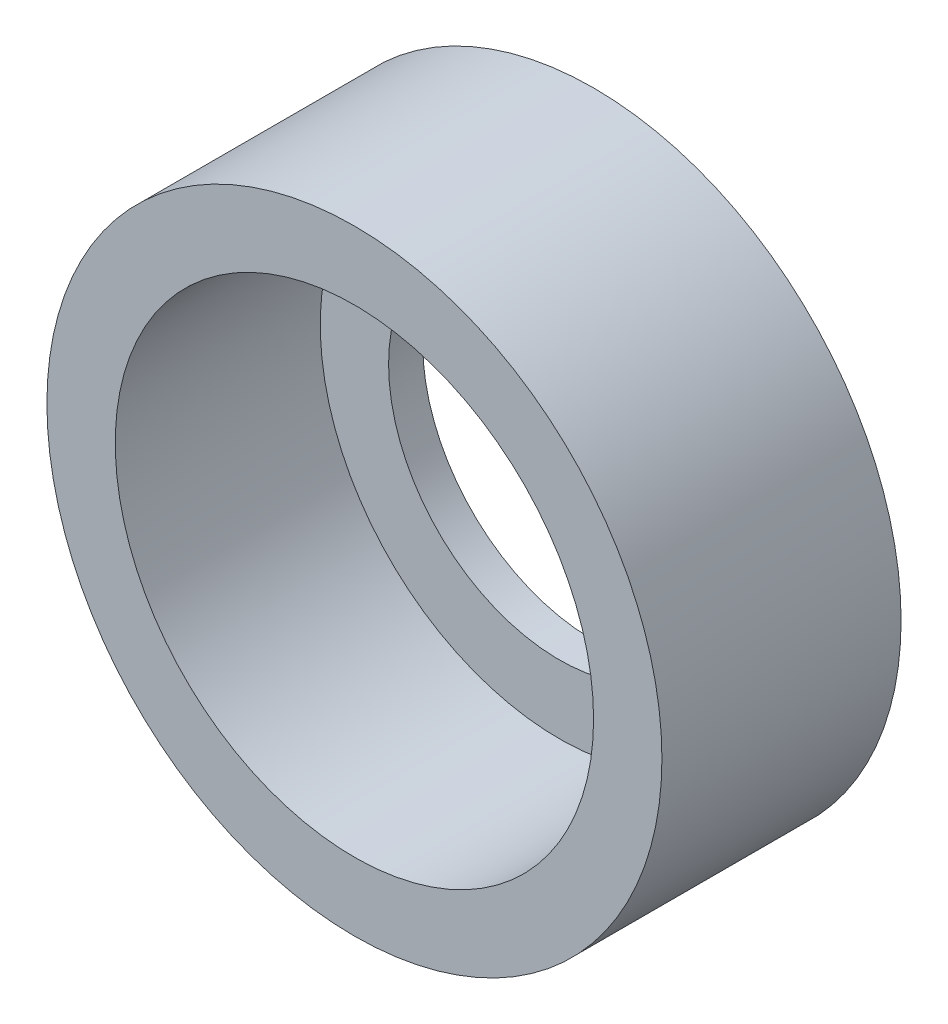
ISO-10303-21;
HEADER;
FILE_DESCRIPTION(('STEP AP214'),'2;1');
FILE_NAME('part.step','',(''),(''),'','','');
FILE_SCHEMA(('AUTOMOTIVE_DESIGN { 1 0 10303 214 1 1 1 1 }'));
ENDSEC;
DATA;
#1=APPLICATION_CONTEXT('core data for automotive mechanical design processes');
#2=APPLICATION_PROTOCOL_DEFINITION('international standard','automotive_design',2000,#1);
#3=PRODUCT_CONTEXT('',#1,'mechanical');
#4=PRODUCT('Part','Part','',(#3));
#5=PRODUCT_RELATED_PRODUCT_CATEGORY('part','',(#4));
#6=PRODUCT_DEFINITION_FORMATION('','',#4);
#7=PRODUCT_DEFINITION_CONTEXT('part definition',#1,'design');
#8=PRODUCT_DEFINITION('design','',#6,#7);
#9=PRODUCT_DEFINITION_SHAPE('','',#8);
#10=(LENGTH_UNIT() NAMED_UNIT(*) SI_UNIT(.MILLI.,.METRE.));
#11=(NAMED_UNIT(*) PLANE_ANGLE_UNIT() SI_UNIT($,.RADIAN.));
#12=(NAMED_UNIT(*) SI_UNIT($,.STERADIAN.) SOLID_ANGLE_UNIT());
#13=UNCERTAINTY_MEASURE_WITH_UNIT(LENGTH_MEASURE(1.E-05),#10,'distance_accuracy_value','');
#14=(GEOMETRIC_REPRESENTATION_CONTEXT(3) GLOBAL_UNCERTAINTY_ASSIGNED_CONTEXT((#13)) GLOBAL_UNIT_ASSIGNED_CONTEXT((#10,
#11,#12)) REPRESENTATION_CONTEXT('',''));
#15=CARTESIAN_POINT('',(0.,0.,0.));
#16=DIRECTION('',(0.,0.,1.));
#17=DIRECTION('',(1.,0.,0.));
#18=AXIS2_PLACEMENT_3D('',#15,#16,#17);
#19=CARTESIAN_POINT('',(0.,0.,3.5));
#20=DIRECTION('',(0.,0.,-1.));
#21=DIRECTION('',(-1.,0.,0.));
#22=AXIS2_PLACEMENT_3D('',#19,#20,#21);
#23=CYLINDRICAL_SURFACE('',#22,4.5);
#24=CARTESIAN_POINT('',(0.,0.,3.5));
#25=DIRECTION('',(0.,0.,1.));
#26=DIRECTION('',(1.,0.,0.));
#27=AXIS2_PLACEMENT_3D('',#24,#25,#26);
#28=CIRCLE('',#27,4.5);
#29=CARTESIAN_POINT('',(4.5,0.,3.5));
#30=VERTEX_POINT('',#29);
#31=EDGE_CURVE('E10',#30,#30,#28,.T.);
#32=ORIENTED_EDGE('',*,*,#31,.F.);
#33=EDGE_LOOP('',(#32));
#34=FACE_BOUND('',#33,.T.);
#35=CARTESIAN_POINT('',(0.,0.,0.));
#36=DIRECTION('',(0.,0.,1.));
#37=DIRECTION('',(1.,0.,0.));
#38=AXIS2_PLACEMENT_3D('',#35,#36,#37);
#39=CIRCLE('',#38,4.5);
#40=CARTESIAN_POINT('',(4.5,0.,0.));
#41=VERTEX_POINT('',#40);
#42=EDGE_CURVE('E34',#41,#41,#39,.T.);
#43=ORIENTED_EDGE('',*,*,#42,.T.);
#44=EDGE_LOOP('',(#43));
#45=FACE_BOUND('',#44,.T.);
#46=ADVANCED_FACE('F27',(#34,#45),#23,.T.);
#47=CARTESIAN_POINT('',(0.,0.,3.5));
#48=DIRECTION('',(0.,0.,1.));
#49=DIRECTION('',(1.,0.,0.));
#50=AXIS2_PLACEMENT_3D('',#47,#48,#49);
#51=PLANE('',#50);
#52=CARTESIAN_POINT('',(0.,0.,3.5));
#53=DIRECTION('',(0.,0.,1.));
#54=DIRECTION('',(1.,0.,0.));
#55=AXIS2_PLACEMENT_3D('',#52,#53,#54);
#56=CIRCLE('',#55,3.49999999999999);
#57=CARTESIAN_POINT('',(3.49999999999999,0.,3.5));
#58=VERTEX_POINT('',#57);
#59=EDGE_CURVE('E43',#58,#58,#56,.T.);
#60=ORIENTED_EDGE('',*,*,#59,.F.);
#61=EDGE_LOOP('',(#60));
#62=FACE_BOUND('',#61,.T.);
#63=ORIENTED_EDGE('',*,*,#31,.T.);
#64=EDGE_LOOP('',(#63));
#65=FACE_BOUND('',#64,.T.);
#66=ADVANCED_FACE('F67',(#62,#65),#51,.T.);
#67=CARTESIAN_POINT('',(0.,0.,0.));
#68=DIRECTION('',(0.,0.,1.));
#69=DIRECTION('',(1.,0.,0.));
#70=AXIS2_PLACEMENT_3D('',#67,#68,#69);
#71=PLANE('',#70);
#72=CARTESIAN_POINT('',(0.,0.,0.));
#73=DIRECTION('',(0.,0.,-1.));
#74=DIRECTION('',(-1.,0.,0.));
#75=AXIS2_PLACEMENT_3D('',#72,#73,#74);
#76=CIRCLE('',#75,2.5);
#77=CARTESIAN_POINT('',(-2.5,0.,0.));
#78=VERTEX_POINT('',#77);
#79=EDGE_CURVE('E46',#78,#78,#76,.T.);
#80=ORIENTED_EDGE('',*,*,#79,.F.);
#81=EDGE_LOOP('',(#80));
#82=FACE_BOUND('',#81,.T.);
#83=ORIENTED_EDGE('',*,*,#42,.F.);
#84=EDGE_LOOP('',(#83));
#85=FACE_BOUND('',#84,.T.);
#86=ADVANCED_FACE('F72',(#82,#85),#71,.F.);
#87=CARTESIAN_POINT('',(0.,0.,0.5));
#88=DIRECTION('',(0.,0.,-1.));
#89=DIRECTION('',(-1.,0.,0.));
#90=AXIS2_PLACEMENT_3D('',#87,#88,#89);
#91=PLANE('',#90);
#92=CARTESIAN_POINT('',(0.,0.,0.5));
#93=DIRECTION('',(0.,0.,-1.));
#94=DIRECTION('',(-1.,0.,0.));
#95=AXIS2_PLACEMENT_3D('',#92,#93,#94);
#96=CIRCLE('',#95,2.5);
#97=CARTESIAN_POINT('',(-2.5,0.,0.5));
#98=VERTEX_POINT('',#97);
#99=EDGE_CURVE('E30',#98,#98,#96,.T.);
#100=ORIENTED_EDGE('',*,*,#99,.T.);
#101=EDGE_LOOP('',(#100));
#102=FACE_BOUND('',#101,.T.);
#103=CARTESIAN_POINT('',(0.,0.,0.5));
#104=DIRECTION('',(0.,0.,1.));
#105=DIRECTION('',(1.,0.,0.));
#106=AXIS2_PLACEMENT_3D('',#103,#104,#105);
#107=CIRCLE('',#106,3.5);
#108=CARTESIAN_POINT('',(3.5,0.,0.5));
#109=VERTEX_POINT('',#108);
#110=EDGE_CURVE('E38',#109,#109,#107,.T.);
#111=ORIENTED_EDGE('',*,*,#110,.T.);
#112=EDGE_LOOP('',(#111));
#113=FACE_BOUND('',#112,.T.);
#114=ADVANCED_FACE('F53',(#102,#113),#91,.F.);
#115=CARTESIAN_POINT('',(0.,0.,3.5));
#116=DIRECTION('',(0.,0.,1.));
#117=DIRECTION('',(1.,0.,0.));
#118=AXIS2_PLACEMENT_3D('',#115,#116,#117);
#119=CYLINDRICAL_SURFACE('',#118,3.49999999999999);
#120=ORIENTED_EDGE('',*,*,#110,.F.);
#121=EDGE_LOOP('',(#120));
#122=FACE_BOUND('',#121,.T.);
#123=ORIENTED_EDGE('',*,*,#59,.T.);
#124=EDGE_LOOP('',(#123));
#125=FACE_BOUND('',#124,.T.);
#126=ADVANCED_FACE('F58',(#122,#125),#119,.F.);
#127=CARTESIAN_POINT('',(0.,0.,3.5));
#128=DIRECTION('',(0.,0.,-1.));
#129=DIRECTION('',(-1.,0.,0.));
#130=AXIS2_PLACEMENT_3D('',#127,#128,#129);
#131=CYLINDRICAL_SURFACE('',#130,2.5);
#132=ORIENTED_EDGE('',*,*,#79,.T.);
#133=EDGE_LOOP('',(#132));
#134=FACE_BOUND('',#133,.T.);
#135=ORIENTED_EDGE('',*,*,#99,.F.);
#136=EDGE_LOOP('',(#135));
#137=FACE_BOUND('',#136,.T.);
#138=ADVANCED_FACE('F56',(#134,#137),#131,.F.);
#139=CLOSED_SHELL('',(#46,#66,#86,#114,#126,#138));
#140=MANIFOLD_SOLID_BREP('B2',#139);
#141=ADVANCED_BREP_SHAPE_REPRESENTATION('',(#18,#140),#14);
#142=SHAPE_DEFINITION_REPRESENTATION(#9,#141);
ENDSEC;
END-ISO-10303-21;
